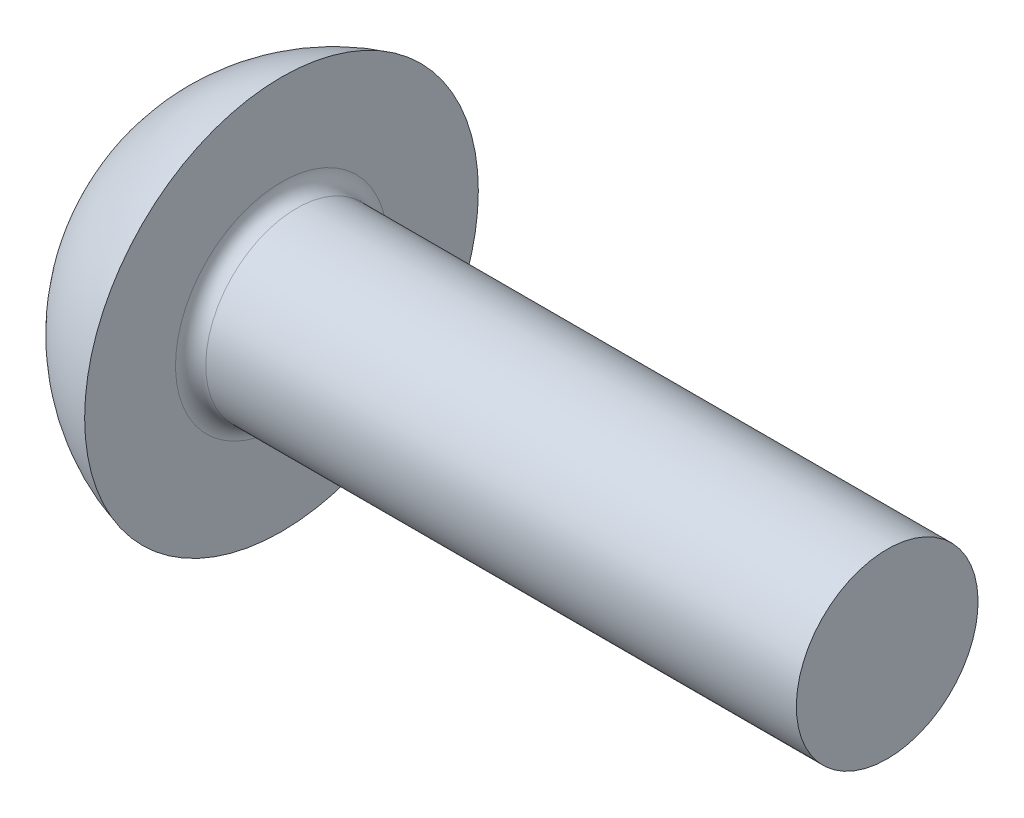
from build123d import *

# Parameters (mm, degrees)
FILLET1_R = 0.05


with BuildPart() as part:
    # Sketch1 → Base-Revolve (revolve)
    with BuildSketch(Plane(origin=(3.103362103, 2.453362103, 0), x_dir=(0, 1, 0), z_dir=(0, 0, 1))):
        with BuildLine():
            Line((-2.453362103, 0.603362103), (-2.453362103, 3.103362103))
            ThreePointArc((-2.453362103, 3.103362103), (-2.043331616, 2.963901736), (-1.803362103, 2.603362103))
            Line((-1.803362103, 2.603362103), (-2.153362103, 2.603362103))
            Line((-2.153362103, 2.603362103), (-2.153362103, 0.603362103))
            Line((-2.153362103, 0.603362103), (-2.453362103, 0.603362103))
        make_face()
    revolve(axis=Axis((-3.989694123, 0, 0), (1, 0, 0)))

    # Fillet1
    fillet1_edges = [part.edges().sort_by_distance(p)[0] for p in [
        (0.5, -0.3, 0),
    ]]
    fillet(fillet1_edges, radius=FILLET1_R)


solid = part.part
